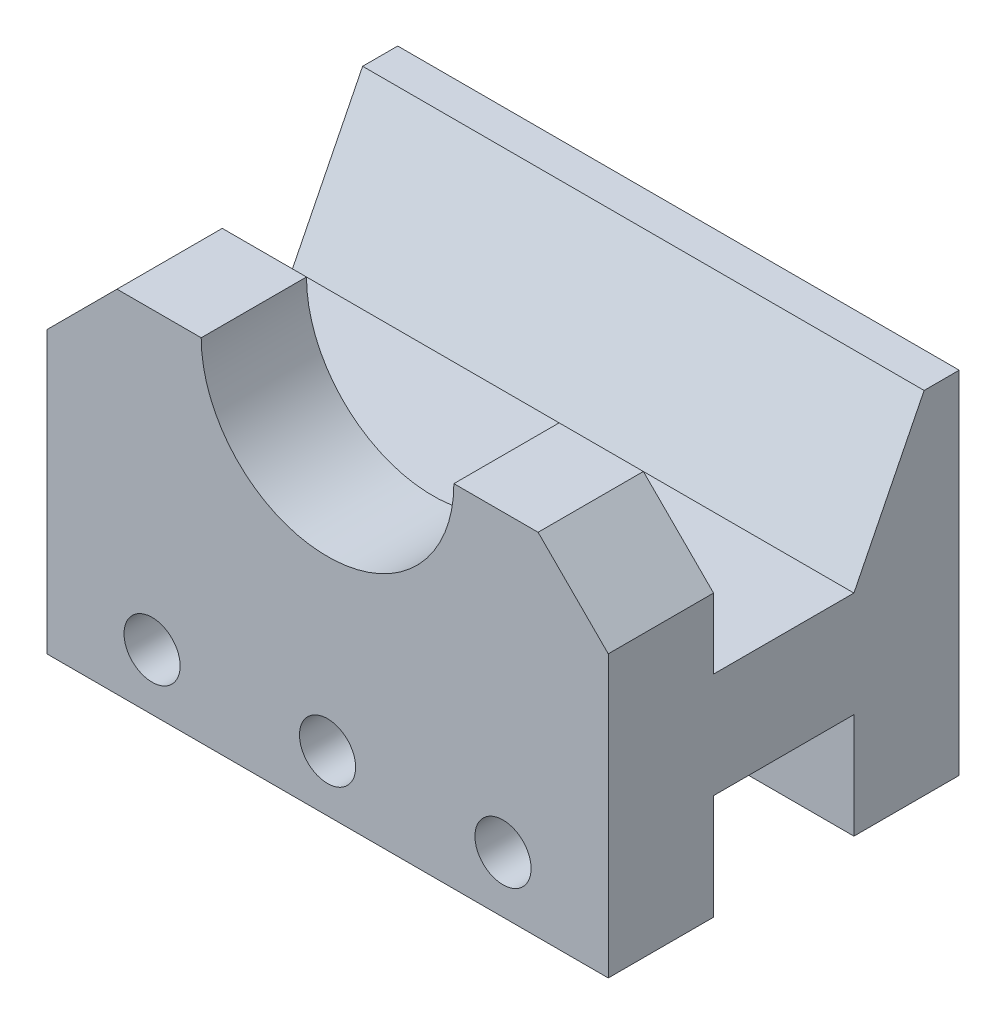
from build123d import *

# Parameters (mm, degrees)
SKETCH_1_W          = 80
SKETCH_1_H          = 50
EXTRUDE_1_DEPTH     = 50
SKETCH_2_W          = 20
SKETCH_2_H          = 15
CUT_EXTRUDE_1_DEPTH = 107.77078252
CUT_EXTRUDE_2_DEPTH = 107.77078252
CUT_EXTRUDE_3_REACH = 108.771
SKETCH_4_R          = 18
CHAMFER_1_SIZE      = 10
SKETCH_5_R          = 4
CUT_EXTRUDE_4_DEPTH = 107.77078252


with BuildPart() as part:
    # Sketch 1 → Extrude 1 (new body)
    with BuildSketch(Plane(origin=(0, 0, 0), x_dir=(1, 0, 0), z_dir=(0, 1, 0))):
        with Locations((40, 25)):
            Rectangle(SKETCH_1_W, SKETCH_1_H)
    extrude(amount=EXTRUDE_1_DEPTH)

    # Sketch 2 → Cut-Extrude 1 (cut, through all)
    with BuildSketch(Plane.ZY):
        with Locations((-25, 7.5)):
            Rectangle(SKETCH_2_W, SKETCH_2_H)
    extrude(amount=-CUT_EXTRUDE_1_DEPTH, mode=Mode.SUBTRACT)

    # Sketch 3 → Cut-Extrude 2 (cut, through all)
    with BuildSketch(Plane.ZY):
        Polygon((-15, 50), (-15, 30), (-35, 30), (-45, 50), align=None)
    extrude(amount=-CUT_EXTRUDE_2_DEPTH, mode=Mode.SUBTRACT)

    # Sketch 4 → Cut-Extrude 3 (cut, up to next)
    with BuildSketch(Plane.XY, mode=Mode.PRIVATE) as cut_extrude_3_sk1:
        with Locations((40, 50)):
            Circle(SKETCH_4_R)
    cut_extrude_3_tool1 = extrude(cut_extrude_3_sk1.sketch, amount=-CUT_EXTRUDE_3_REACH, mode=Mode.PRIVATE) & part.part
    add(cut_extrude_3_tool1.solids().sort_by_distance((40, 50, 0))[0], mode=Mode.SUBTRACT)

    # Chamfer 1
    chamfer_1_edges = [part.edges().sort_by_distance(p)[0] for p in [
        (80, 50, -7.5),
        (0, 50, -7.5),
    ]]
    chamfer(chamfer_1_edges, length=CHAMFER_1_SIZE)

    # Sketch 5 → Cut-Extrude 4 (cut, through all)
    with BuildSketch(Plane.XY):
        with Locations((15, 8)):
            Circle(SKETCH_5_R)
        with Locations((40, 8)):
            Circle(SKETCH_5_R)
        with Locations((65, 8)):
            Circle(SKETCH_5_R)
    extrude(amount=-CUT_EXTRUDE_4_DEPTH, mode=Mode.SUBTRACT)


solid = part.part
